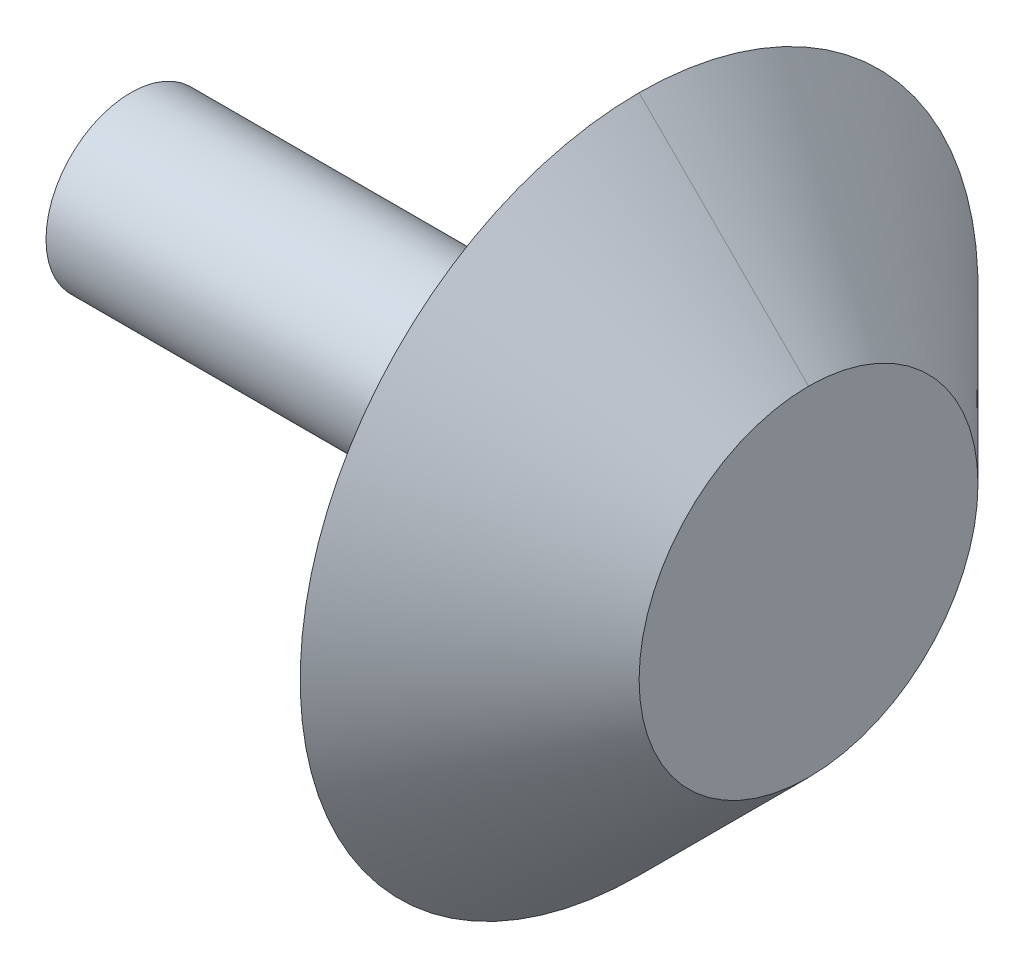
ISO-10303-21;
HEADER;
FILE_DESCRIPTION(('STEP AP214'),'2;1');
FILE_NAME('part.step','',(''),(''),'','','');
FILE_SCHEMA(('AUTOMOTIVE_DESIGN { 1 0 10303 214 1 1 1 1 }'));
ENDSEC;
DATA;
#1=APPLICATION_CONTEXT('core data for automotive mechanical design processes');
#2=APPLICATION_PROTOCOL_DEFINITION('international standard','automotive_design',2000,#1);
#3=PRODUCT_CONTEXT('',#1,'mechanical');
#4=PRODUCT('Part','Part','',(#3));
#5=PRODUCT_RELATED_PRODUCT_CATEGORY('part','',(#4));
#6=PRODUCT_DEFINITION_FORMATION('','',#4);
#7=PRODUCT_DEFINITION_CONTEXT('part definition',#1,'design');
#8=PRODUCT_DEFINITION('design','',#6,#7);
#9=PRODUCT_DEFINITION_SHAPE('','',#8);
#10=(LENGTH_UNIT() NAMED_UNIT(*) SI_UNIT(.MILLI.,.METRE.));
#11=(NAMED_UNIT(*) PLANE_ANGLE_UNIT() SI_UNIT($,.RADIAN.));
#12=(NAMED_UNIT(*) SI_UNIT($,.STERADIAN.) SOLID_ANGLE_UNIT());
#13=UNCERTAINTY_MEASURE_WITH_UNIT(LENGTH_MEASURE(1.E-05),#10,'distance_accuracy_value','');
#14=(GEOMETRIC_REPRESENTATION_CONTEXT(3) GLOBAL_UNCERTAINTY_ASSIGNED_CONTEXT((#13)) GLOBAL_UNIT_ASSIGNED_CONTEXT((#10,
#11,#12)) REPRESENTATION_CONTEXT('',''));
#15=CARTESIAN_POINT('',(0.,0.,0.));
#16=DIRECTION('',(0.,0.,1.));
#17=DIRECTION('',(1.,0.,0.));
#18=AXIS2_PLACEMENT_3D('',#15,#16,#17);
#19=CARTESIAN_POINT('',(76.2,0.,0.));
#20=DIRECTION('',(-1.,0.,0.));
#21=DIRECTION('',(0.,0.,1.));
#22=AXIS2_PLACEMENT_3D('',#19,#20,#21);
#23=CONICAL_SURFACE('',#22,19.0500000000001,0.785398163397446);
#24=CARTESIAN_POINT('',(76.2,0.,0.));
#25=DIRECTION('',(-1.,0.,0.));
#26=DIRECTION('',(0.,0.,1.));
#27=AXIS2_PLACEMENT_3D('',#24,#25,#26);
#28=CIRCLE('',#27,19.0500000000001);
#29=CARTESIAN_POINT('',(76.2,19.0500000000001,0.));
#30=VERTEX_POINT('',#29);
#31=CARTESIAN_POINT('',(76.2,-19.0500000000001,0.));
#32=VERTEX_POINT('',#31);
#33=EDGE_CURVE('E378',#30,#32,#28,.T.);
#34=ORIENTED_EDGE('',*,*,#33,.T.);
#35=DIRECTION('',(-0.707106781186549,-0.707106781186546,0.));
#36=VECTOR('',#35,1.);
#37=CARTESIAN_POINT('',(76.2,-19.0500000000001,0.));
#38=LINE('',#37,#36);
#39=CARTESIAN_POINT('',(57.15,-38.1,0.));
#40=VERTEX_POINT('',#39);
#41=EDGE_CURVE('E11',#32,#40,#38,.T.);
#42=ORIENTED_EDGE('',*,*,#41,.T.);
#43=CARTESIAN_POINT('',(57.15,0.,0.));
#44=DIRECTION('',(-1.,0.,0.));
#45=DIRECTION('',(0.,0.,1.));
#46=AXIS2_PLACEMENT_3D('',#43,#44,#45);
#47=CIRCLE('',#46,38.1);
#48=CARTESIAN_POINT('',(57.15,38.1,0.));
#49=VERTEX_POINT('',#48);
#50=EDGE_CURVE('E377',#49,#40,#47,.T.);
#51=ORIENTED_EDGE('',*,*,#50,.F.);
#52=DIRECTION('',(0.707106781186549,-0.707106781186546,0.));
#53=VECTOR('',#52,1.);
#54=CARTESIAN_POINT('',(76.2,19.0500000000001,0.));
#55=LINE('',#54,#53);
#56=EDGE_CURVE('E357',#49,#30,#55,.T.);
#57=ORIENTED_EDGE('',*,*,#56,.T.);
#58=EDGE_LOOP('',(#34,#42,#51,#57));
#59=FACE_BOUND('',#58,.T.);
#60=ADVANCED_FACE('F348',(#59),#23,.T.);
#61=CARTESIAN_POINT('',(0.,0.,0.));
#62=DIRECTION('',(1.,0.,0.));
#63=DIRECTION('',(0.,0.,-1.));
#64=AXIS2_PLACEMENT_3D('',#61,#62,#63);
#65=PLANE('',#64);
#66=CARTESIAN_POINT('',(0.,0.,0.));
#67=DIRECTION('',(-1.,0.,0.));
#68=DIRECTION('',(0.,0.,1.));
#69=AXIS2_PLACEMENT_3D('',#66,#67,#68);
#70=CIRCLE('',#69,9.525);
#71=CARTESIAN_POINT('',(0.,0.,9.525));
#72=VERTEX_POINT('',#71);
#73=EDGE_CURVE('E385',#72,#72,#70,.T.);
#74=ORIENTED_EDGE('',*,*,#73,.T.);
#75=EDGE_LOOP('',(#74));
#76=FACE_BOUND('',#75,.T.);
#77=ADVANCED_FACE('F350',(#76),#65,.F.);
#78=CARTESIAN_POINT('',(0.,0.,0.));
#79=DIRECTION('',(-1.,0.,0.));
#80=DIRECTION('',(0.,0.,1.));
#81=AXIS2_PLACEMENT_3D('',#78,#79,#80);
#82=CYLINDRICAL_SURFACE('',#81,9.525);
#83=ORIENTED_EDGE('',*,*,#73,.F.);
#84=EDGE_LOOP('',(#83));
#85=FACE_BOUND('',#84,.T.);
#86=CARTESIAN_POINT('',(57.15,0.,0.));
#87=DIRECTION('',(-1.,0.,0.));
#88=DIRECTION('',(0.,0.,1.));
#89=AXIS2_PLACEMENT_3D('',#86,#87,#88);
#90=CIRCLE('',#89,9.525);
#91=CARTESIAN_POINT('',(57.15,0.,9.525));
#92=VERTEX_POINT('',#91);
#93=EDGE_CURVE('E386',#92,#92,#90,.T.);
#94=ORIENTED_EDGE('',*,*,#93,.T.);
#95=EDGE_LOOP('',(#94));
#96=FACE_BOUND('',#95,.T.);
#97=ADVANCED_FACE('F395',(#85,#96),#82,.T.);
#98=CARTESIAN_POINT('',(57.15,9.525,0.));
#99=DIRECTION('',(1.,0.,0.));
#100=DIRECTION('',(0.,0.,-1.));
#101=AXIS2_PLACEMENT_3D('',#98,#99,#100);
#102=PLANE('',#101);
#103=ORIENTED_EDGE('',*,*,#93,.F.);
#104=EDGE_LOOP('',(#103));
#105=FACE_BOUND('',#104,.T.);
#106=ORIENTED_EDGE('',*,*,#50,.T.);
#107=EDGE_CURVE('E374',#40,#49,#47,.T.);
#108=ORIENTED_EDGE('',*,*,#107,.T.);
#109=EDGE_LOOP('',(#106,#108));
#110=FACE_BOUND('',#109,.T.);
#111=ADVANCED_FACE('F376',(#105,#110),#102,.F.);
#112=ORIENTED_EDGE('',*,*,#41,.F.);
#113=EDGE_CURVE('E382',#32,#30,#28,.T.);
#114=ORIENTED_EDGE('',*,*,#113,.T.);
#115=ORIENTED_EDGE('',*,*,#56,.F.);
#116=ORIENTED_EDGE('',*,*,#107,.F.);
#117=EDGE_LOOP('',(#112,#114,#115,#116));
#118=FACE_BOUND('',#117,.T.);
#119=ADVANCED_FACE('F381',(#118),#23,.T.);
#120=CARTESIAN_POINT('',(76.2,19.0500000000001,0.));
#121=DIRECTION('',(-1.,0.,0.));
#122=DIRECTION('',(0.,0.,1.));
#123=AXIS2_PLACEMENT_3D('',#120,#121,#122);
#124=PLANE('',#123);
#125=ORIENTED_EDGE('',*,*,#33,.F.);
#126=ORIENTED_EDGE('',*,*,#113,.F.);
#127=EDGE_LOOP('',(#125,#126));
#128=FACE_BOUND('',#127,.T.);
#129=ADVANCED_FACE('F406',(#128),#124,.F.);
#130=CLOSED_SHELL('',(#60,#77,#97,#111,#119,#129));
#131=MANIFOLD_SOLID_BREP('B2',#130);
#132=ADVANCED_BREP_SHAPE_REPRESENTATION('',(#18,#131),#14);
#133=SHAPE_DEFINITION_REPRESENTATION(#9,#132);
ENDSEC;
END-ISO-10303-21;
